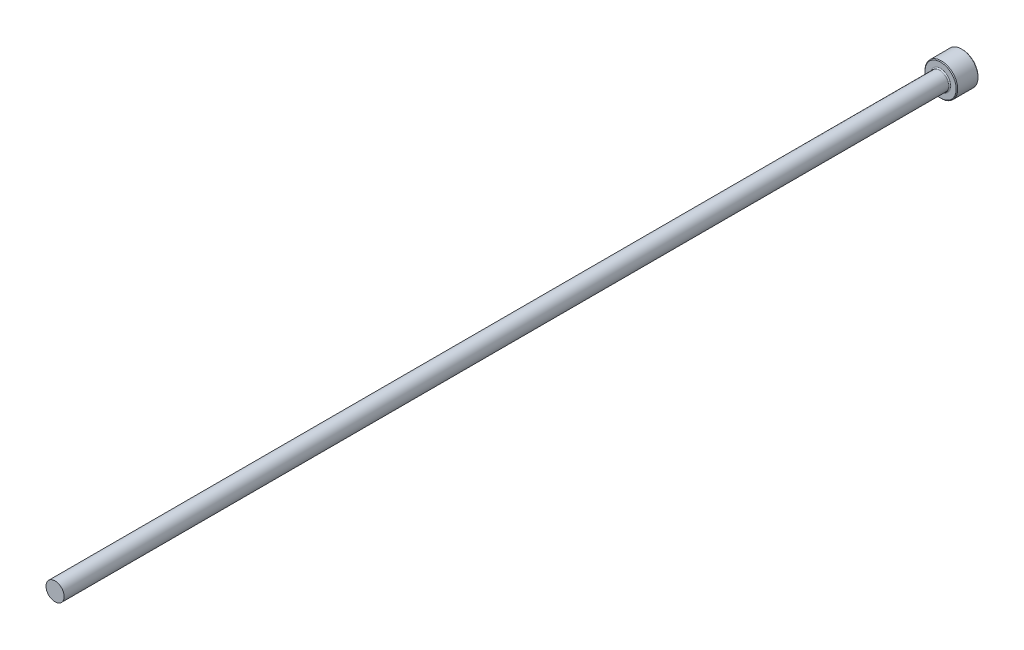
ISO-10303-21;
HEADER;
FILE_DESCRIPTION(('STEP AP214'),'2;1');
FILE_NAME('part.step','',(''),(''),'','','');
FILE_SCHEMA(('AUTOMOTIVE_DESIGN { 1 0 10303 214 1 1 1 1 }'));
ENDSEC;
DATA;
#1=APPLICATION_CONTEXT('core data for automotive mechanical design processes');
#2=APPLICATION_PROTOCOL_DEFINITION('international standard','automotive_design',2000,#1);
#3=PRODUCT_CONTEXT('',#1,'mechanical');
#4=PRODUCT('Part','Part','',(#3));
#5=PRODUCT_RELATED_PRODUCT_CATEGORY('part','',(#4));
#6=PRODUCT_DEFINITION_FORMATION('','',#4);
#7=PRODUCT_DEFINITION_CONTEXT('part definition',#1,'design');
#8=PRODUCT_DEFINITION('design','',#6,#7);
#9=PRODUCT_DEFINITION_SHAPE('','',#8);
#10=(LENGTH_UNIT() NAMED_UNIT(*) SI_UNIT(.MILLI.,.METRE.));
#11=(NAMED_UNIT(*) PLANE_ANGLE_UNIT() SI_UNIT($,.RADIAN.));
#12=(NAMED_UNIT(*) SI_UNIT($,.STERADIAN.) SOLID_ANGLE_UNIT());
#13=UNCERTAINTY_MEASURE_WITH_UNIT(LENGTH_MEASURE(1.E-05),#10,'distance_accuracy_value','');
#14=(GEOMETRIC_REPRESENTATION_CONTEXT(3) GLOBAL_UNCERTAINTY_ASSIGNED_CONTEXT((#13)) GLOBAL_UNIT_ASSIGNED_CONTEXT((#10,
#11,#12)) REPRESENTATION_CONTEXT('',''));
#15=CARTESIAN_POINT('',(0.,0.,0.));
#16=DIRECTION('',(0.,0.,1.));
#17=DIRECTION('',(1.,0.,0.));
#18=AXIS2_PLACEMENT_3D('',#15,#16,#17);
#19=CARTESIAN_POINT('',(0.,2.49999999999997,250.));
#20=DIRECTION('',(0.,0.,-1.));
#21=DIRECTION('',(-1.,0.,0.));
#22=AXIS2_PLACEMENT_3D('',#19,#20,#21);
#23=PLANE('',#22);
#24=CARTESIAN_POINT('',(0.,0.,250.));
#25=DIRECTION('',(0.,0.,1.));
#26=DIRECTION('',(1.,0.,0.));
#27=AXIS2_PLACEMENT_3D('',#24,#25,#26);
#28=CIRCLE('',#27,2.49999999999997);
#29=CARTESIAN_POINT('',(2.49999999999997,0.,250.));
#30=VERTEX_POINT('',#29);
#31=EDGE_CURVE('E50',#30,#30,#28,.T.);
#32=ORIENTED_EDGE('',*,*,#31,.T.);
#33=EDGE_LOOP('',(#32));
#34=FACE_BOUND('',#33,.T.);
#35=ADVANCED_FACE('F30',(#34),#23,.F.);
#36=CARTESIAN_POINT('',(0.,0.,109.050628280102));
#37=DIRECTION('',(0.,0.,1.));
#38=DIRECTION('',(1.,0.,0.));
#39=AXIS2_PLACEMENT_3D('',#36,#37,#38);
#40=CYLINDRICAL_SURFACE('',#39,2.49999999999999);
#41=ORIENTED_EDGE('',*,*,#31,.F.);
#42=EDGE_LOOP('',(#41));
#43=FACE_BOUND('',#42,.T.);
#44=CARTESIAN_POINT('',(0.,0.,6.3));
#45=DIRECTION('',(0.,0.,1.));
#46=DIRECTION('',(1.,0.,0.));
#47=AXIS2_PLACEMENT_3D('',#44,#45,#46);
#48=CIRCLE('',#47,2.5);
#49=CARTESIAN_POINT('',(2.5,0.,6.3));
#50=VERTEX_POINT('',#49);
#51=EDGE_CURVE('E53',#50,#50,#48,.T.);
#52=ORIENTED_EDGE('',*,*,#51,.T.);
#53=EDGE_LOOP('',(#52));
#54=FACE_BOUND('',#53,.T.);
#55=ADVANCED_FACE('F73',(#43,#54),#40,.T.);
#56=CARTESIAN_POINT('',(0.,0.,6.3));
#57=DIRECTION('',(0.,0.,1.));
#58=DIRECTION('',(1.,0.,0.));
#59=AXIS2_PLACEMENT_3D('',#56,#57,#58);
#60=TOROIDAL_SURFACE('',#59,2.8,0.3);
#61=ORIENTED_EDGE('',*,*,#51,.F.);
#62=EDGE_LOOP('',(#61));
#63=FACE_BOUND('',#62,.T.);
#64=CARTESIAN_POINT('',(0.,0.,6.00000000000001));
#65=DIRECTION('',(0.,0.,1.));
#66=DIRECTION('',(1.,0.,0.));
#67=AXIS2_PLACEMENT_3D('',#64,#65,#66);
#68=CIRCLE('',#67,2.8);
#69=CARTESIAN_POINT('',(2.8,0.,6.00000000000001));
#70=VERTEX_POINT('',#69);
#71=EDGE_CURVE('E56',#70,#70,#68,.T.);
#72=ORIENTED_EDGE('',*,*,#71,.T.);
#73=EDGE_LOOP('',(#72));
#74=FACE_BOUND('',#73,.T.);
#75=ADVANCED_FACE('F60',(#63,#74),#60,.F.);
#76=CARTESIAN_POINT('',(0.,4.5,6.));
#77=DIRECTION('',(0.,0.,-1.));
#78=DIRECTION('',(-1.,0.,0.));
#79=AXIS2_PLACEMENT_3D('',#76,#77,#78);
#80=PLANE('',#79);
#81=CARTESIAN_POINT('',(0.,0.,6.));
#82=DIRECTION('',(0.,0.,-1.));
#83=DIRECTION('',(-1.,0.,0.));
#84=AXIS2_PLACEMENT_3D('',#81,#82,#83);
#85=CIRCLE('',#84,4.30000000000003);
#86=CARTESIAN_POINT('',(-4.30000000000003,0.,6.));
#87=VERTEX_POINT('',#86);
#88=EDGE_CURVE('E10',#87,#87,#85,.F.);
#89=ORIENTED_EDGE('',*,*,#88,.T.);
#90=EDGE_LOOP('',(#89));
#91=FACE_BOUND('',#90,.T.);
#92=ORIENTED_EDGE('',*,*,#71,.F.);
#93=EDGE_LOOP('',(#92));
#94=FACE_BOUND('',#93,.T.);
#95=ADVANCED_FACE('F62',(#91,#94),#80,.F.);
#96=CARTESIAN_POINT('',(0.,0.,109.050628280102));
#97=DIRECTION('',(0.,0.,1.));
#98=DIRECTION('',(1.,0.,0.));
#99=AXIS2_PLACEMENT_3D('',#96,#97,#98);
#100=CYLINDRICAL_SURFACE('',#99,4.5);
#101=CARTESIAN_POINT('',(0.,0.,0.200000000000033));
#102=DIRECTION('',(0.,0.,1.));
#103=DIRECTION('',(1.,0.,0.));
#104=AXIS2_PLACEMENT_3D('',#101,#102,#103);
#105=CIRCLE('',#104,4.5);
#106=CARTESIAN_POINT('',(4.5,0.,0.200000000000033));
#107=VERTEX_POINT('',#106);
#108=EDGE_CURVE('E41',#107,#107,#105,.T.);
#109=ORIENTED_EDGE('',*,*,#108,.T.);
#110=EDGE_LOOP('',(#109));
#111=FACE_BOUND('',#110,.T.);
#112=CARTESIAN_POINT('',(0.,0.,5.80000000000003));
#113=DIRECTION('',(0.,0.,-1.));
#114=DIRECTION('',(-1.,0.,0.));
#115=AXIS2_PLACEMENT_3D('',#112,#113,#114);
#116=CIRCLE('',#115,4.5);
#117=CARTESIAN_POINT('',(-4.5,0.,5.80000000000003));
#118=VERTEX_POINT('',#117);
#119=EDGE_CURVE('E45',#118,#118,#116,.T.);
#120=ORIENTED_EDGE('',*,*,#119,.T.);
#121=EDGE_LOOP('',(#120));
#122=FACE_BOUND('',#121,.T.);
#123=ADVANCED_FACE('F64',(#111,#122),#100,.T.);
#124=CARTESIAN_POINT('',(0.,0.,0.));
#125=DIRECTION('',(0.,0.,1.));
#126=DIRECTION('',(1.,0.,0.));
#127=AXIS2_PLACEMENT_3D('',#124,#125,#126);
#128=PLANE('',#127);
#129=CARTESIAN_POINT('',(0.,0.,0.));
#130=DIRECTION('',(0.,0.,1.));
#131=DIRECTION('',(1.,0.,0.));
#132=AXIS2_PLACEMENT_3D('',#129,#130,#131);
#133=CIRCLE('',#132,4.29999999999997);
#134=CARTESIAN_POINT('',(4.29999999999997,0.,0.));
#135=VERTEX_POINT('',#134);
#136=EDGE_CURVE('E37',#135,#135,#133,.F.);
#137=ORIENTED_EDGE('',*,*,#136,.T.);
#138=EDGE_LOOP('',(#137));
#139=FACE_BOUND('',#138,.T.);
#140=ADVANCED_FACE('F70',(#139),#128,.F.);
#141=CARTESIAN_POINT('',(0.,0.,0.200000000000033));
#142=DIRECTION('',(0.,0.,1.));
#143=DIRECTION('',(1.,0.,0.));
#144=AXIS2_PLACEMENT_3D('',#141,#142,#143);
#145=CONICAL_SURFACE('',#144,4.5,0.785398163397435);
#146=ORIENTED_EDGE('',*,*,#136,.F.);
#147=EDGE_LOOP('',(#146));
#148=FACE_BOUND('',#147,.T.);
#149=ORIENTED_EDGE('',*,*,#108,.F.);
#150=EDGE_LOOP('',(#149));
#151=FACE_BOUND('',#150,.T.);
#152=ADVANCED_FACE('F84',(#148,#151),#145,.T.);
#153=CARTESIAN_POINT('',(0.,0.,6.00000000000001));
#154=DIRECTION('',(0.,0.,-1.));
#155=DIRECTION('',(-1.,0.,0.));
#156=AXIS2_PLACEMENT_3D('',#153,#154,#155);
#157=CONICAL_SURFACE('',#156,4.30000000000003,0.785398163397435);
#158=CARTESIAN_POINT('',(-4.5,0.,5.80000000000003));
#159=CARTESIAN_POINT('',(-4.49791666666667,0.,5.80208333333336));
#160=CARTESIAN_POINT('',(-4.49583333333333,0.,5.80416666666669));
#161=CARTESIAN_POINT('',(-4.49166666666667,0.,5.80833333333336));
#162=CARTESIAN_POINT('',(-4.48958333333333,0.,5.81041666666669));
#163=CARTESIAN_POINT('',(-4.48541666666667,0.,5.81458333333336));
#164=CARTESIAN_POINT('',(-4.48333333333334,0.,5.81666666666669));
#165=CARTESIAN_POINT('',(-4.47916666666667,0.,5.82083333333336));
#166=CARTESIAN_POINT('',(-4.47708333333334,0.,5.82291666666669));
#167=CARTESIAN_POINT('',(-4.47291666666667,0.,5.82708333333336));
#168=CARTESIAN_POINT('',(-4.47083333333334,0.,5.82916666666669));
#169=CARTESIAN_POINT('',(-4.46666666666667,0.,5.83333333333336));
#170=CARTESIAN_POINT('',(-4.46458333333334,0.,5.83541666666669));
#171=CARTESIAN_POINT('',(-4.46041666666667,0.,5.83958333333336));
#172=CARTESIAN_POINT('',(-4.45833333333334,0.,5.84166666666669));
#173=CARTESIAN_POINT('',(-4.45416666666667,0.,5.84583333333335));
#174=CARTESIAN_POINT('',(-4.45208333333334,0.,5.84791666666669));
#175=CARTESIAN_POINT('',(-4.44791666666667,0.,5.85208333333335));
#176=CARTESIAN_POINT('',(-4.44583333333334,0.,5.85416666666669));
#177=CARTESIAN_POINT('',(-4.44166666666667,0.,5.85833333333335));
#178=CARTESIAN_POINT('',(-4.43958333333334,0.,5.86041666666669));
#179=CARTESIAN_POINT('',(-4.43541666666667,0.,5.86458333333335));
#180=CARTESIAN_POINT('',(-4.43333333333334,0.,5.86666666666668));
#181=CARTESIAN_POINT('',(-4.42916666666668,0.,5.87083333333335));
#182=CARTESIAN_POINT('',(-4.42708333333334,0.,5.87291666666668));
#183=CARTESIAN_POINT('',(-4.42291666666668,0.,5.87708333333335));
#184=CARTESIAN_POINT('',(-4.42083333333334,0.,5.87916666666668));
#185=CARTESIAN_POINT('',(-4.41666666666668,0.,5.88333333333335));
#186=CARTESIAN_POINT('',(-4.41458333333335,0.,5.88541666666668));
#187=CARTESIAN_POINT('',(-4.41041666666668,0.,5.88958333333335));
#188=CARTESIAN_POINT('',(-4.40833333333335,0.,5.89166666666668));
#189=CARTESIAN_POINT('',(-4.40416666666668,0.,5.89583333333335));
#190=CARTESIAN_POINT('',(-4.40208333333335,0.,5.89791666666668));
#191=CARTESIAN_POINT('',(-4.39791666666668,0.,5.90208333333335));
#192=CARTESIAN_POINT('',(-4.39583333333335,0.,5.90416666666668));
#193=CARTESIAN_POINT('',(-4.39166666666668,0.,5.90833333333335));
#194=CARTESIAN_POINT('',(-4.38958333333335,0.,5.91041666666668));
#195=CARTESIAN_POINT('',(-4.38541666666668,0.,5.91458333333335));
#196=CARTESIAN_POINT('',(-4.38333333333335,0.,5.91666666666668));
#197=CARTESIAN_POINT('',(-4.37916666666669,0.,5.92083333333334));
#198=CARTESIAN_POINT('',(-4.37708333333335,0.,5.92291666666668));
#199=CARTESIAN_POINT('',(-4.37291666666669,0.,5.92708333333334));
#200=CARTESIAN_POINT('',(-4.37083333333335,0.,5.92916666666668));
#201=CARTESIAN_POINT('',(-4.36666666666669,0.,5.93333333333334));
#202=CARTESIAN_POINT('',(-4.36458333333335,0.,5.93541666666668));
#203=CARTESIAN_POINT('',(-4.36041666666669,0.,5.93958333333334));
#204=CARTESIAN_POINT('',(-4.35833333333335,0.,5.94166666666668));
#205=CARTESIAN_POINT('',(-4.35416666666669,0.,5.94583333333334));
#206=CARTESIAN_POINT('',(-4.35208333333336,0.,5.94791666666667));
#207=CARTESIAN_POINT('',(-4.34791666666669,0.,5.95208333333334));
#208=CARTESIAN_POINT('',(-4.34583333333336,0.,5.95416666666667));
#209=CARTESIAN_POINT('',(-4.34166666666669,0.,5.95833333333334));
#210=CARTESIAN_POINT('',(-4.33958333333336,0.,5.96041666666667));
#211=CARTESIAN_POINT('',(-4.33541666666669,0.,5.96458333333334));
#212=CARTESIAN_POINT('',(-4.33333333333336,0.,5.96666666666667));
#213=CARTESIAN_POINT('',(-4.32916666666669,0.,5.97083333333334));
#214=CARTESIAN_POINT('',(-4.32708333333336,0.,5.97291666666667));
#215=CARTESIAN_POINT('',(-4.32291666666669,0.,5.97708333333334));
#216=CARTESIAN_POINT('',(-4.32083333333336,0.,5.97916666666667));
#217=CARTESIAN_POINT('',(-4.31666666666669,0.,5.98333333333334));
#218=CARTESIAN_POINT('',(-4.31458333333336,0.,5.98541666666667));
#219=CARTESIAN_POINT('',(-4.3104166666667,0.,5.98958333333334));
#220=CARTESIAN_POINT('',(-4.30833333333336,0.,5.99166666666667));
#221=CARTESIAN_POINT('',(-4.3041666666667,0.,5.99583333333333));
#222=CARTESIAN_POINT('',(-4.30208333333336,0.,5.99791666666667));
#223=CARTESIAN_POINT('',(-4.30000000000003,0.,6.));
#224=B_SPLINE_CURVE_WITH_KNOTS('',3,(#158,#159,#160,#161,#162,#163,#164,#165,#166,#167,#168,
#169,#170,#171,#172,#173,#174,#175,#176,#177,#178,#179,#180,#181,#182,#183,#184,#185,#186,#187,
#188,#189,#190,#191,#192,#193,#194,#195,#196,#197,#198,#199,#200,#201,#202,#203,#204,#205,#206,
#207,#208,#209,#210,#211,#212,#213,#214,#215,#216,#217,#218,#219,#220,#221,#222,#223),
.UNSPECIFIED.,.F.,.F.,(4,2,2,2,2,2,2,2,2,2,2,2,2,2,2,2,2,2,2,2,2,2,2,2,2,2,2,2,2,2,2,2,4),(0.,
0.00883883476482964,0.0176776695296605,0.0265165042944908,0.0353553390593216,0.0441941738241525,
0.0530330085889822,0.061871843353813,0.0707106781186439,0.0795495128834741,0.088388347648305,
0.0972271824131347,0.106066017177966,0.114904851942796,0.123743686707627,0.132582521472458,
0.141421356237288,0.150260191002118,0.159099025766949,0.167937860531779,0.17677669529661,
0.185615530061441,0.194454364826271,0.203293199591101,0.212132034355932,0.220970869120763,
0.229809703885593,0.238648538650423,0.247487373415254,0.256326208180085,0.265165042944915,
0.274003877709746,0.282842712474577),.UNSPECIFIED.);
#225=EDGE_CURVE('BSEAM32',#118,#87,#224,.T.);
#226=ORIENTED_EDGE('',*,*,#119,.F.);
#227=ORIENTED_EDGE('',*,*,#88,.F.);
#228=ORIENTED_EDGE('',*,*,#225,.T.);
#229=ORIENTED_EDGE('',*,*,#225,.F.);
#230=EDGE_LOOP('',(#226,#228,#227,#229));
#231=FACE_BOUND('',#230,.T.);
#232=ADVANCED_FACE('F32',(#231),#157,.T.);
#233=CLOSED_SHELL('',(#35,#55,#75,#95,#123,#140,#152,#232));
#234=MANIFOLD_SOLID_BREP('B2',#233);
#235=ADVANCED_BREP_SHAPE_REPRESENTATION('',(#18,#234),#14);
#236=SHAPE_DEFINITION_REPRESENTATION(#9,#235);
ENDSEC;
END-ISO-10303-21;
